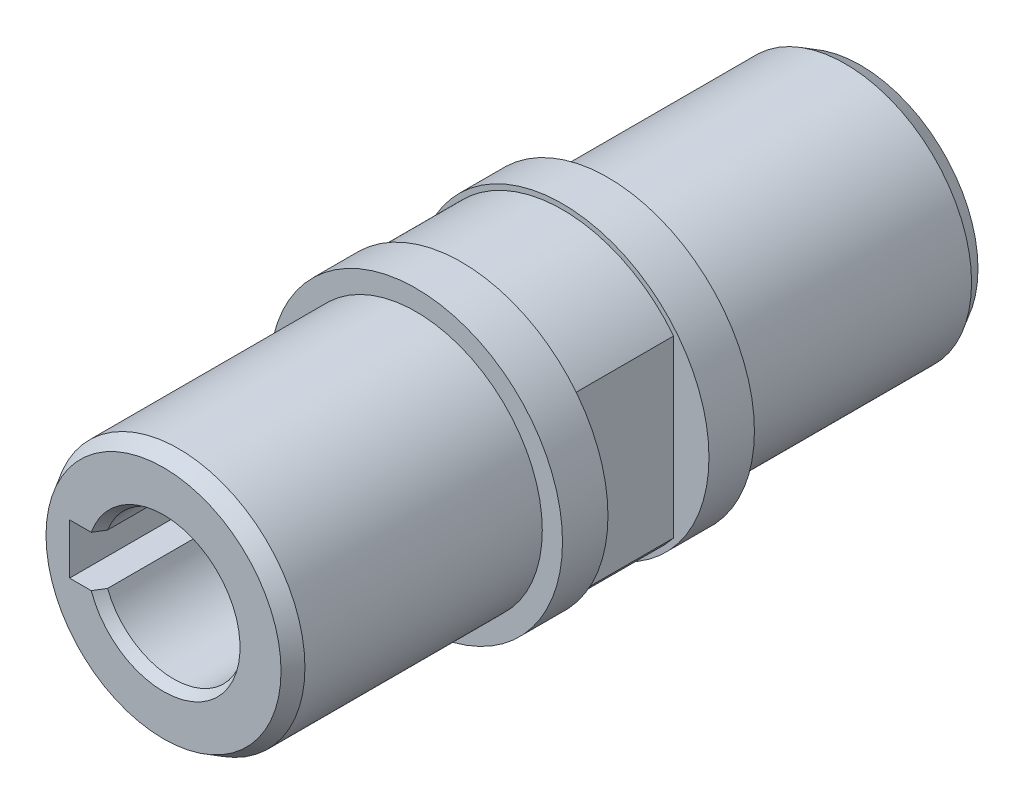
ISO-10303-21;
HEADER;
FILE_DESCRIPTION(('STEP AP214'),'2;1');
FILE_NAME('part.step','',(''),(''),'','','');
FILE_SCHEMA(('AUTOMOTIVE_DESIGN { 1 0 10303 214 1 1 1 1 }'));
ENDSEC;
DATA;
#1=APPLICATION_CONTEXT('core data for automotive mechanical design processes');
#2=APPLICATION_PROTOCOL_DEFINITION('international standard','automotive_design',2000,#1);
#3=PRODUCT_CONTEXT('',#1,'mechanical');
#4=PRODUCT('Part','Part','',(#3));
#5=PRODUCT_RELATED_PRODUCT_CATEGORY('part','',(#4));
#6=PRODUCT_DEFINITION_FORMATION('','',#4);
#7=PRODUCT_DEFINITION_CONTEXT('part definition',#1,'design');
#8=PRODUCT_DEFINITION('design','',#6,#7);
#9=PRODUCT_DEFINITION_SHAPE('','',#8);
#10=(LENGTH_UNIT() NAMED_UNIT(*) SI_UNIT(.MILLI.,.METRE.));
#11=(NAMED_UNIT(*) PLANE_ANGLE_UNIT() SI_UNIT($,.RADIAN.));
#12=(NAMED_UNIT(*) SI_UNIT($,.STERADIAN.) SOLID_ANGLE_UNIT());
#13=UNCERTAINTY_MEASURE_WITH_UNIT(LENGTH_MEASURE(1.E-05),#10,'distance_accuracy_value','');
#14=(GEOMETRIC_REPRESENTATION_CONTEXT(3) GLOBAL_UNCERTAINTY_ASSIGNED_CONTEXT((#13)) GLOBAL_UNIT_ASSIGNED_CONTEXT((#10,
#11,#12)) REPRESENTATION_CONTEXT('',''));
#15=CARTESIAN_POINT('',(0.,0.,0.));
#16=DIRECTION('',(0.,0.,1.));
#17=DIRECTION('',(1.,0.,0.));
#18=AXIS2_PLACEMENT_3D('',#15,#16,#17);
#19=CARTESIAN_POINT('',(0.,0.,-22.5));
#20=DIRECTION('',(0.,0.,1.));
#21=DIRECTION('',(1.,0.,0.));
#22=AXIS2_PLACEMENT_3D('',#19,#20,#21);
#23=PLANE('',#22);
#24=CARTESIAN_POINT('',(0.,0.,-22.5));
#25=DIRECTION('',(0.,0.,1.));
#26=DIRECTION('',(1.,0.,0.));
#27=AXIS2_PLACEMENT_3D('',#24,#25,#26);
#28=CIRCLE('',#27,14.5);
#29=CARTESIAN_POINT('',(14.5,0.,-22.5));
#30=VERTEX_POINT('',#29);
#31=EDGE_CURVE('E192',#30,#30,#28,.F.);
#32=ORIENTED_EDGE('',*,*,#31,.F.);
#33=EDGE_LOOP('',(#32));
#34=FACE_BOUND('',#33,.T.);
#35=CARTESIAN_POINT('',(0.,0.,-22.5));
#36=DIRECTION('',(0.,0.,-1.));
#37=DIRECTION('',(-1.,0.,0.));
#38=AXIS2_PLACEMENT_3D('',#35,#36,#37);
#39=CIRCLE('',#38,12.5);
#40=CARTESIAN_POINT('',(-12.5,0.,-22.5));
#41=VERTEX_POINT('',#40);
#42=EDGE_CURVE('E19',#41,#41,#39,.F.);
#43=ORIENTED_EDGE('',*,*,#42,.F.);
#44=EDGE_LOOP('',(#43));
#45=FACE_BOUND('',#44,.T.);
#46=ADVANCED_FACE('F15',(#34,#45),#23,.T.);
#47=CARTESIAN_POINT('',(0.,0.,-22.5));
#48=DIRECTION('',(0.,0.,-1.));
#49=DIRECTION('',(-1.,0.,0.));
#50=AXIS2_PLACEMENT_3D('',#47,#48,#49);
#51=CYLINDRICAL_SURFACE('',#50,12.5);
#52=ORIENTED_EDGE('',*,*,#42,.T.);
#53=EDGE_LOOP('',(#52));
#54=FACE_BOUND('',#53,.T.);
#55=CARTESIAN_POINT('',(0.,0.,0.999999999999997));
#56=DIRECTION('',(0.,0.,-1.));
#57=DIRECTION('',(-1.,0.,0.));
#58=AXIS2_PLACEMENT_3D('',#55,#56,#57);
#59=CIRCLE('',#58,12.5);
#60=CARTESIAN_POINT('',(-12.5,0.,0.999999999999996));
#61=VERTEX_POINT('',#60);
#62=EDGE_CURVE('E187',#61,#61,#59,.F.);
#63=ORIENTED_EDGE('',*,*,#62,.F.);
#64=EDGE_LOOP('',(#63));
#65=FACE_BOUND('',#64,.T.);
#66=ADVANCED_FACE('F365',(#54,#65),#51,.T.);
#67=CARTESIAN_POINT('',(0.,0.,2.49999999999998));
#68=DIRECTION('',(0.,0.,1.));
#69=DIRECTION('',(1.,0.,0.));
#70=AXIS2_PLACEMENT_3D('',#67,#68,#69);
#71=CYLINDRICAL_SURFACE('',#70,14.5);
#72=ORIENTED_EDGE('',*,*,#31,.T.);
#73=EDGE_LOOP('',(#72));
#74=FACE_BOUND('',#73,.T.);
#75=CARTESIAN_POINT('',(0.,0.,-27.));
#76=DIRECTION('',(0.,0.,1.));
#77=DIRECTION('',(1.,0.,0.));
#78=AXIS2_PLACEMENT_3D('',#75,#76,#77);
#79=CIRCLE('',#78,14.5);
#80=CARTESIAN_POINT('',(14.5,0.,-27.));
#81=VERTEX_POINT('',#80);
#82=EDGE_CURVE('E350',#81,#81,#79,.T.);
#83=ORIENTED_EDGE('',*,*,#82,.T.);
#84=EDGE_LOOP('',(#83));
#85=FACE_BOUND('',#84,.T.);
#86=ADVANCED_FACE('F374',(#74,#85),#71,.T.);
#87=CARTESIAN_POINT('',(0.,0.,0.999999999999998));
#88=DIRECTION('',(0.,0.,-1.));
#89=DIRECTION('',(-1.,0.,0.));
#90=AXIS2_PLACEMENT_3D('',#87,#88,#89);
#91=CONICAL_SURFACE('',#90,12.5,0.523598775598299);
#92=CARTESIAN_POINT('',(0.,0.,2.49999999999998));
#93=DIRECTION('',(0.,0.,-1.));
#94=DIRECTION('',(-1.,0.,0.));
#95=AXIS2_PLACEMENT_3D('',#92,#93,#94);
#96=CIRCLE('',#95,11.6339745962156);
#97=CARTESIAN_POINT('',(-11.6339745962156,0.,2.49999999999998));
#98=VERTEX_POINT('',#97);
#99=EDGE_CURVE('E386',#98,#98,#96,.F.);
#100=ORIENTED_EDGE('',*,*,#99,.F.);
#101=EDGE_LOOP('',(#100));
#102=FACE_BOUND('',#101,.T.);
#103=ORIENTED_EDGE('',*,*,#62,.T.);
#104=EDGE_LOOP('',(#103));
#105=FACE_BOUND('',#104,.T.);
#106=ADVANCED_FACE('F199',(#102,#105),#91,.T.);
#107=CARTESIAN_POINT('',(0.,0.,2.49999999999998));
#108=DIRECTION('',(0.,0.,1.));
#109=DIRECTION('',(1.,0.,0.));
#110=AXIS2_PLACEMENT_3D('',#107,#108,#109);
#111=CONICAL_SURFACE('',#110,7.57735026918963,0.523598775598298);
#112=CARTESIAN_POINT('',(0.,0.,1.49999999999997));
#113=DIRECTION('',(0.,0.,-1.));
#114=DIRECTION('',(-1.,0.,0.));
#115=AXIS2_PLACEMENT_3D('',#112,#113,#114);
#116=CIRCLE('',#115,7.);
#117=CARTESIAN_POINT('',(-6.53834841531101,2.5,1.49999999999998));
#118=VERTEX_POINT('',#117);
#119=CARTESIAN_POINT('',(-6.53834841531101,-2.5,1.49999999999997));
#120=VERTEX_POINT('',#119);
#121=EDGE_CURVE('E329',#118,#120,#116,.T.);
#122=ORIENTED_EDGE('',*,*,#121,.T.);
#123=CARTESIAN_POINT('',(-7.15305788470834,-2.5,2.49999999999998));
#124=CARTESIAN_POINT('',(-7.05099975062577,-2.5,2.33309149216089));
#125=CARTESIAN_POINT('',(-6.94874489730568,-2.5,2.1663039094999));
#126=CARTESIAN_POINT('',(-6.74384174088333,-2.5,1.83297057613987));
#127=CARTESIAN_POINT('',(-6.64119343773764,-2.5,1.66642482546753));
#128=CARTESIAN_POINT('',(-6.53834841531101,-2.5,1.49999999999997));
#129=B_SPLINE_CURVE_WITH_KNOTS('',3,(#123,#124,#125,#126,#127,#128),.UNSPECIFIED.,.F.,.F.,(4,2,
4),(0.,0.586913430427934,1.17382692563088),.UNSPECIFIED.);
#130=CARTESIAN_POINT('',(-7.15305788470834,-2.5,2.49999999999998));
#131=VERTEX_POINT('',#130);
#132=EDGE_CURVE('E96',#131,#120,#129,.T.);
#133=ORIENTED_EDGE('',*,*,#132,.F.);
#134=CARTESIAN_POINT('',(0.,0.,2.49999999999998));
#135=DIRECTION('',(0.,0.,1.));
#136=DIRECTION('',(1.,0.,0.));
#137=AXIS2_PLACEMENT_3D('',#134,#135,#136);
#138=CIRCLE('',#137,7.57735026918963);
#139=CARTESIAN_POINT('',(-7.15305788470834,2.5,2.49999999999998));
#140=VERTEX_POINT('',#139);
#141=EDGE_CURVE('E331',#140,#131,#138,.F.);
#142=ORIENTED_EDGE('',*,*,#141,.F.);
#143=CARTESIAN_POINT('',(-6.53834841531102,2.5,1.49999999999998));
#144=CARTESIAN_POINT('',(-6.64119343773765,2.5,1.66642482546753));
#145=CARTESIAN_POINT('',(-6.74384174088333,2.5,1.83297057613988));
#146=CARTESIAN_POINT('',(-6.94874489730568,2.5,2.1663039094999));
#147=CARTESIAN_POINT('',(-7.05099975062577,2.5,2.33309149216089));
#148=CARTESIAN_POINT('',(-7.15305788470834,2.5,2.49999999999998));
#149=B_SPLINE_CURVE_WITH_KNOTS('',3,(#143,#144,#145,#146,#147,#148),.UNSPECIFIED.,.F.,.F.,(4,2,
4),(0.,0.586913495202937,1.17382692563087),.UNSPECIFIED.);
#150=EDGE_CURVE('E186',#118,#140,#149,.T.);
#151=ORIENTED_EDGE('',*,*,#150,.F.);
#152=EDGE_LOOP('',(#122,#133,#142,#151));
#153=FACE_BOUND('',#152,.T.);
#154=ADVANCED_FACE('F193',(#153),#111,.F.);
#155=CARTESIAN_POINT('',(0.,7.25,-24.5));
#156=DIRECTION('',(0.,0.,1.));
#157=DIRECTION('',(1.,0.,0.));
#158=AXIS2_PLACEMENT_3D('',#155,#156,#157);
#159=PLANE('',#158);
#160=CARTESIAN_POINT('',(0.,0.,-24.5));
#161=DIRECTION('',(0.,0.,1.));
#162=DIRECTION('',(1.,0.,0.));
#163=AXIS2_PLACEMENT_3D('',#160,#161,#162);
#164=CIRCLE('',#163,7.25);
#165=CARTESIAN_POINT('',(-6.8053287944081,2.5,-24.5));
#166=VERTEX_POINT('',#165);
#167=CARTESIAN_POINT('',(-6.8053287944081,-2.5,-24.5));
#168=VERTEX_POINT('',#167);
#169=EDGE_CURVE('E394',#166,#168,#164,.F.);
#170=ORIENTED_EDGE('',*,*,#169,.T.);
#171=DIRECTION('',(1.,0.,0.));
#172=VECTOR('',#171,1.);
#173=CARTESIAN_POINT('',(0.,-2.5,-24.5));
#174=LINE('',#173,#172);
#175=CARTESIAN_POINT('',(-6.53834841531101,-2.5,-24.5));
#176=VERTEX_POINT('',#175);
#177=EDGE_CURVE('E351',#176,#168,#174,.F.);
#178=ORIENTED_EDGE('',*,*,#177,.F.);
#179=CARTESIAN_POINT('',(0.,0.,-24.5));
#180=DIRECTION('',(0.,0.,-1.));
#181=DIRECTION('',(-1.,0.,0.));
#182=AXIS2_PLACEMENT_3D('',#179,#180,#181);
#183=CIRCLE('',#182,7.);
#184=CARTESIAN_POINT('',(-6.53834841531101,2.5,-24.5));
#185=VERTEX_POINT('',#184);
#186=EDGE_CURVE('E330',#176,#185,#183,.F.);
#187=ORIENTED_EDGE('',*,*,#186,.T.);
#188=DIRECTION('',(1.,0.,0.));
#189=VECTOR('',#188,1.);
#190=CARTESIAN_POINT('',(0.,2.5,-24.5));
#191=LINE('',#190,#189);
#192=EDGE_CURVE('E348',#166,#185,#191,.T.);
#193=ORIENTED_EDGE('',*,*,#192,.F.);
#194=EDGE_LOOP('',(#170,#178,#187,#193));
#195=FACE_BOUND('',#194,.T.);
#196=ADVANCED_FACE('F198',(#195),#159,.F.);
#197=CARTESIAN_POINT('',(0.,7.,-39.5));
#198=DIRECTION('',(0.,0.,-1.));
#199=DIRECTION('',(-1.,0.,0.));
#200=AXIS2_PLACEMENT_3D('',#197,#198,#199);
#201=PLANE('',#200);
#202=CARTESIAN_POINT('',(0.,0.,-39.5));
#203=DIRECTION('',(0.,0.,-1.));
#204=DIRECTION('',(-1.,0.,0.));
#205=AXIS2_PLACEMENT_3D('',#202,#203,#204);
#206=CIRCLE('',#205,7.);
#207=CARTESIAN_POINT('',(-6.53834841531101,2.5,-39.5));
#208=VERTEX_POINT('',#207);
#209=CARTESIAN_POINT('',(-6.53834841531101,-2.5,-39.5));
#210=VERTEX_POINT('',#209);
#211=EDGE_CURVE('E384',#208,#210,#206,.T.);
#212=ORIENTED_EDGE('',*,*,#211,.T.);
#213=DIRECTION('',(-1.,0.,0.));
#214=VECTOR('',#213,1.);
#215=CARTESIAN_POINT('',(0.,-2.5,-39.5));
#216=LINE('',#215,#214);
#217=CARTESIAN_POINT('',(-6.8053287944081,-2.5,-39.5));
#218=VERTEX_POINT('',#217);
#219=EDGE_CURVE('E345',#218,#210,#216,.F.);
#220=ORIENTED_EDGE('',*,*,#219,.F.);
#221=CARTESIAN_POINT('',(0.,0.,-39.5));
#222=DIRECTION('',(0.,0.,1.));
#223=DIRECTION('',(1.,0.,0.));
#224=AXIS2_PLACEMENT_3D('',#221,#222,#223);
#225=CIRCLE('',#224,7.25);
#226=CARTESIAN_POINT('',(-6.8053287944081,2.5,-39.5));
#227=VERTEX_POINT('',#226);
#228=EDGE_CURVE('E397',#218,#227,#225,.T.);
#229=ORIENTED_EDGE('',*,*,#228,.T.);
#230=DIRECTION('',(-1.,0.,0.));
#231=VECTOR('',#230,1.);
#232=CARTESIAN_POINT('',(0.,2.5,-39.5));
#233=LINE('',#232,#231);
#234=EDGE_CURVE('E347',#208,#227,#233,.T.);
#235=ORIENTED_EDGE('',*,*,#234,.F.);
#236=EDGE_LOOP('',(#212,#220,#229,#235));
#237=FACE_BOUND('',#236,.T.);
#238=ADVANCED_FACE('F204',(#237),#201,.F.);
#239=CARTESIAN_POINT('',(0.,0.,-27.));
#240=DIRECTION('',(0.,0.,1.));
#241=DIRECTION('',(1.,0.,0.));
#242=AXIS2_PLACEMENT_3D('',#239,#240,#241);
#243=PLANE('',#242);
#244=ORIENTED_EDGE('',*,*,#82,.F.);
#245=EDGE_LOOP('',(#244));
#246=FACE_BOUND('',#245,.T.);
#247=DIRECTION('',(0.,1.,0.));
#248=VECTOR('',#247,1.);
#249=CARTESIAN_POINT('',(11.,-11.,-27.));
#250=LINE('',#249,#248);
#251=CARTESIAN_POINT('',(11.,-8.66025403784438,-27.));
#252=VERTEX_POINT('',#251);
#253=CARTESIAN_POINT('',(11.,8.66025403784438,-27.));
#254=VERTEX_POINT('',#253);
#255=EDGE_CURVE('E133',#252,#254,#250,.T.);
#256=ORIENTED_EDGE('',*,*,#255,.T.);
#257=CARTESIAN_POINT('',(0.,0.,-27.));
#258=DIRECTION('',(0.,0.,-1.));
#259=DIRECTION('',(-1.,0.,0.));
#260=AXIS2_PLACEMENT_3D('',#257,#258,#259);
#261=CIRCLE('',#260,14.);
#262=CARTESIAN_POINT('',(-11.,8.66025403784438,-27.));
#263=VERTEX_POINT('',#262);
#264=EDGE_CURVE('E130',#263,#254,#261,.T.);
#265=ORIENTED_EDGE('',*,*,#264,.F.);
#266=DIRECTION('',(0.,1.,0.));
#267=VECTOR('',#266,1.);
#268=CARTESIAN_POINT('',(-11.,-11.,-27.));
#269=LINE('',#268,#267);
#270=CARTESIAN_POINT('',(-11.,-8.66025403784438,-27.));
#271=VERTEX_POINT('',#270);
#272=EDGE_CURVE('E298',#263,#271,#269,.F.);
#273=ORIENTED_EDGE('',*,*,#272,.T.);
#274=CARTESIAN_POINT('',(0.,0.,-27.));
#275=DIRECTION('',(0.,0.,-1.));
#276=DIRECTION('',(-1.,0.,0.));
#277=AXIS2_PLACEMENT_3D('',#274,#275,#276);
#278=CIRCLE('',#277,14.);
#279=EDGE_CURVE('E300',#252,#271,#278,.T.);
#280=ORIENTED_EDGE('',*,*,#279,.F.);
#281=EDGE_LOOP('',(#256,#265,#273,#280));
#282=FACE_BOUND('',#281,.T.);
#283=ADVANCED_FACE('F208',(#246,#282),#243,.F.);
#284=CARTESIAN_POINT('',(0.,0.,-73.5));
#285=DIRECTION('',(0.,0.,-1.));
#286=DIRECTION('',(-1.,0.,0.));
#287=AXIS2_PLACEMENT_3D('',#284,#285,#286);
#288=CYLINDRICAL_SURFACE('',#287,7.);
#289=DIRECTION('',(0.,0.,1.));
#290=VECTOR('',#289,1.);
#291=CARTESIAN_POINT('',(-6.53834841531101,2.50000000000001,202.5));
#292=LINE('',#291,#290);
#293=CARTESIAN_POINT('',(-6.53834841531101,2.49999999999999,-65.5));
#294=VERTEX_POINT('',#293);
#295=EDGE_CURVE('E291',#294,#208,#292,.T.);
#296=ORIENTED_EDGE('',*,*,#295,.F.);
#297=CARTESIAN_POINT('',(0.,0.,-65.5));
#298=DIRECTION('',(0.,0.,-1.));
#299=DIRECTION('',(-1.,0.,0.));
#300=AXIS2_PLACEMENT_3D('',#297,#298,#299);
#301=CIRCLE('',#300,7.);
#302=CARTESIAN_POINT('',(-6.538348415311,-2.5,-65.5));
#303=VERTEX_POINT('',#302);
#304=EDGE_CURVE('E310',#294,#303,#301,.T.);
#305=ORIENTED_EDGE('',*,*,#304,.T.);
#306=DIRECTION('',(0.,0.,1.));
#307=VECTOR('',#306,1.);
#308=CARTESIAN_POINT('',(-6.53834841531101,-2.50000000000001,-197.5));
#309=LINE('',#308,#307);
#310=EDGE_CURVE('E164',#210,#303,#309,.F.);
#311=ORIENTED_EDGE('',*,*,#310,.F.);
#312=ORIENTED_EDGE('',*,*,#211,.F.);
#313=EDGE_LOOP('',(#296,#305,#311,#312));
#314=FACE_BOUND('',#313,.T.);
#315=ADVANCED_FACE('F212',(#314),#288,.F.);
#316=CARTESIAN_POINT('',(0.,0.,2.49999999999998));
#317=DIRECTION('',(0.,0.,1.));
#318=DIRECTION('',(1.,0.,0.));
#319=AXIS2_PLACEMENT_3D('',#316,#317,#318);
#320=PLANE('',#319);
#321=DIRECTION('',(-1.,0.,0.));
#322=VECTOR('',#321,1.);
#323=CARTESIAN_POINT('',(-9.3,-2.5,2.49999999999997));
#324=LINE('',#323,#322);
#325=CARTESIAN_POINT('',(-9.3,-2.5,2.49999999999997));
#326=VERTEX_POINT('',#325);
#327=EDGE_CURVE('E279',#326,#131,#324,.F.);
#328=ORIENTED_EDGE('',*,*,#327,.F.);
#329=DIRECTION('',(0.,-1.,0.));
#330=VECTOR('',#329,1.);
#331=CARTESIAN_POINT('',(-9.3,2.50000000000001,2.49999999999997));
#332=LINE('',#331,#330);
#333=CARTESIAN_POINT('',(-9.3,2.5,2.49999999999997));
#334=VERTEX_POINT('',#333);
#335=EDGE_CURVE('E104',#326,#334,#332,.F.);
#336=ORIENTED_EDGE('',*,*,#335,.T.);
#337=DIRECTION('',(1.,0.,0.));
#338=VECTOR('',#337,1.);
#339=CARTESIAN_POINT('',(-9.3,2.5,2.49999999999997));
#340=LINE('',#339,#338);
#341=EDGE_CURVE('E292',#140,#334,#340,.F.);
#342=ORIENTED_EDGE('',*,*,#341,.F.);
#343=ORIENTED_EDGE('',*,*,#141,.T.);
#344=EDGE_LOOP('',(#328,#336,#342,#343));
#345=FACE_BOUND('',#344,.T.);
#346=ORIENTED_EDGE('',*,*,#99,.T.);
#347=EDGE_LOOP('',(#346));
#348=FACE_BOUND('',#347,.T.);
#349=ADVANCED_FACE('F216',(#345,#348),#320,.T.);
#350=CARTESIAN_POINT('',(0.,0.,-73.5));
#351=DIRECTION('',(0.,0.,-1.));
#352=DIRECTION('',(-1.,0.,0.));
#353=AXIS2_PLACEMENT_3D('',#350,#351,#352);
#354=CYLINDRICAL_SURFACE('',#353,7.);
#355=ORIENTED_EDGE('',*,*,#186,.F.);
#356=DIRECTION('',(0.,0.,1.));
#357=VECTOR('',#356,1.);
#358=CARTESIAN_POINT('',(-6.53834841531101,-2.50000000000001,-197.5));
#359=LINE('',#358,#357);
#360=EDGE_CURVE('E151',#120,#176,#359,.F.);
#361=ORIENTED_EDGE('',*,*,#360,.F.);
#362=ORIENTED_EDGE('',*,*,#121,.F.);
#363=DIRECTION('',(0.,0.,1.));
#364=VECTOR('',#363,1.);
#365=CARTESIAN_POINT('',(-6.53834841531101,2.50000000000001,202.5));
#366=LINE('',#365,#364);
#367=EDGE_CURVE('E318',#185,#118,#366,.T.);
#368=ORIENTED_EDGE('',*,*,#367,.F.);
#369=EDGE_LOOP('',(#355,#361,#362,#368));
#370=FACE_BOUND('',#369,.T.);
#371=ADVANCED_FACE('F220',(#370),#354,.F.);
#372=CARTESIAN_POINT('',(0.,0.,-73.5));
#373=DIRECTION('',(0.,0.,1.));
#374=DIRECTION('',(1.,0.,0.));
#375=AXIS2_PLACEMENT_3D('',#372,#373,#374);
#376=CYLINDRICAL_SURFACE('',#375,7.25);
#377=ORIENTED_EDGE('',*,*,#228,.F.);
#378=DIRECTION('',(0.,0.,1.));
#379=VECTOR('',#378,1.);
#380=CARTESIAN_POINT('',(-6.8053287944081,-2.50000000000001,-197.5));
#381=LINE('',#380,#379);
#382=EDGE_CURVE('E148',#168,#218,#381,.F.);
#383=ORIENTED_EDGE('',*,*,#382,.F.);
#384=ORIENTED_EDGE('',*,*,#169,.F.);
#385=DIRECTION('',(0.,0.,1.));
#386=VECTOR('',#385,1.);
#387=CARTESIAN_POINT('',(-6.8053287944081,2.50000000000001,202.5));
#388=LINE('',#387,#386);
#389=EDGE_CURVE('E307',#227,#166,#388,.T.);
#390=ORIENTED_EDGE('',*,*,#389,.F.);
#391=EDGE_LOOP('',(#377,#383,#384,#390));
#392=FACE_BOUND('',#391,.T.);
#393=ADVANCED_FACE('F224',(#392),#376,.F.);
#394=CARTESIAN_POINT('',(0.,0.,-37.));
#395=DIRECTION('',(0.,0.,-1.));
#396=DIRECTION('',(-1.,0.,0.));
#397=AXIS2_PLACEMENT_3D('',#394,#395,#396);
#398=CYLINDRICAL_SURFACE('',#397,14.);
#399=CARTESIAN_POINT('',(0.,0.,-37.));
#400=DIRECTION('',(0.,0.,-1.));
#401=DIRECTION('',(-1.,0.,0.));
#402=AXIS2_PLACEMENT_3D('',#399,#400,#401);
#403=CIRCLE('',#402,14.);
#404=CARTESIAN_POINT('',(-11.,8.66025403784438,-37.));
#405=VERTEX_POINT('',#404);
#406=CARTESIAN_POINT('',(11.,8.66025403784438,-37.));
#407=VERTEX_POINT('',#406);
#408=EDGE_CURVE('E128',#405,#407,#403,.T.);
#409=ORIENTED_EDGE('',*,*,#408,.F.);
#410=DIRECTION('',(0.,0.,-1.));
#411=VECTOR('',#410,1.);
#412=CARTESIAN_POINT('',(-11.,8.66025403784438,-27.));
#413=LINE('',#412,#411);
#414=EDGE_CURVE('E297',#405,#263,#413,.F.);
#415=ORIENTED_EDGE('',*,*,#414,.T.);
#416=ORIENTED_EDGE('',*,*,#264,.T.);
#417=DIRECTION('',(0.,0.,1.));
#418=VECTOR('',#417,1.);
#419=CARTESIAN_POINT('',(11.,8.66025403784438,-27.));
#420=LINE('',#419,#418);
#421=EDGE_CURVE('E123',#254,#407,#420,.F.);
#422=ORIENTED_EDGE('',*,*,#421,.T.);
#423=EDGE_LOOP('',(#409,#415,#416,#422));
#424=FACE_BOUND('',#423,.T.);
#425=ADVANCED_FACE('F125',(#424),#398,.T.);
#426=CARTESIAN_POINT('',(11.,-11.,-27.));
#427=DIRECTION('',(-1.,0.,0.));
#428=DIRECTION('',(0.,0.,1.));
#429=AXIS2_PLACEMENT_3D('',#426,#427,#428);
#430=PLANE('',#429);
#431=DIRECTION('',(0.,1.,0.));
#432=VECTOR('',#431,1.);
#433=CARTESIAN_POINT('',(11.,0.,-37.));
#434=LINE('',#433,#432);
#435=CARTESIAN_POINT('',(11.,-8.66025403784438,-37.));
#436=VERTEX_POINT('',#435);
#437=EDGE_CURVE('E136',#407,#436,#434,.F.);
#438=ORIENTED_EDGE('',*,*,#437,.F.);
#439=ORIENTED_EDGE('',*,*,#421,.F.);
#440=ORIENTED_EDGE('',*,*,#255,.F.);
#441=DIRECTION('',(0.,0.,-1.));
#442=VECTOR('',#441,1.);
#443=CARTESIAN_POINT('',(11.,-8.66025403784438,-37.));
#444=LINE('',#443,#442);
#445=EDGE_CURVE('E132',#436,#252,#444,.F.);
#446=ORIENTED_EDGE('',*,*,#445,.F.);
#447=EDGE_LOOP('',(#438,#439,#440,#446));
#448=FACE_BOUND('',#447,.T.);
#449=ADVANCED_FACE('F137',(#448),#430,.F.);
#450=CARTESIAN_POINT('',(0.,0.,-37.));
#451=DIRECTION('',(0.,0.,-1.));
#452=DIRECTION('',(-1.,0.,0.));
#453=AXIS2_PLACEMENT_3D('',#450,#451,#452);
#454=CYLINDRICAL_SURFACE('',#453,14.);
#455=ORIENTED_EDGE('',*,*,#279,.T.);
#456=DIRECTION('',(0.,0.,-1.));
#457=VECTOR('',#456,1.);
#458=CARTESIAN_POINT('',(-11.,-8.66025403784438,-27.));
#459=LINE('',#458,#457);
#460=CARTESIAN_POINT('',(-11.,-8.66025403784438,-37.));
#461=VERTEX_POINT('',#460);
#462=EDGE_CURVE('E295',#271,#461,#459,.T.);
#463=ORIENTED_EDGE('',*,*,#462,.T.);
#464=CARTESIAN_POINT('',(0.,0.,-37.));
#465=DIRECTION('',(0.,0.,-1.));
#466=DIRECTION('',(-1.,0.,0.));
#467=AXIS2_PLACEMENT_3D('',#464,#465,#466);
#468=CIRCLE('',#467,14.);
#469=EDGE_CURVE('E142',#436,#461,#468,.T.);
#470=ORIENTED_EDGE('',*,*,#469,.F.);
#471=ORIENTED_EDGE('',*,*,#445,.T.);
#472=EDGE_LOOP('',(#455,#463,#470,#471));
#473=FACE_BOUND('',#472,.T.);
#474=ADVANCED_FACE('F233',(#473),#454,.T.);
#475=CARTESIAN_POINT('',(-11.,-11.,-27.));
#476=DIRECTION('',(1.,0.,0.));
#477=DIRECTION('',(0.,0.,-1.));
#478=AXIS2_PLACEMENT_3D('',#475,#476,#477);
#479=PLANE('',#478);
#480=DIRECTION('',(0.,1.,0.));
#481=VECTOR('',#480,1.);
#482=CARTESIAN_POINT('',(-11.,0.,-37.));
#483=LINE('',#482,#481);
#484=EDGE_CURVE('E147',#461,#405,#483,.T.);
#485=ORIENTED_EDGE('',*,*,#484,.F.);
#486=ORIENTED_EDGE('',*,*,#462,.F.);
#487=ORIENTED_EDGE('',*,*,#272,.F.);
#488=ORIENTED_EDGE('',*,*,#414,.F.);
#489=EDGE_LOOP('',(#485,#486,#487,#488));
#490=FACE_BOUND('',#489,.T.);
#491=ADVANCED_FACE('F236',(#490),#479,.F.);
#492=CARTESIAN_POINT('',(-9.3,2.50000000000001,202.5));
#493=DIRECTION('',(-1.,0.,0.));
#494=DIRECTION('',(0.,-1.,0.));
#495=AXIS2_PLACEMENT_3D('',#492,#493,#494);
#496=PLANE('',#495);
#497=DIRECTION('',(0.,0.,1.));
#498=VECTOR('',#497,1.);
#499=CARTESIAN_POINT('',(-9.3,-2.50000000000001,-197.5));
#500=LINE('',#499,#498);
#501=CARTESIAN_POINT('',(-9.3,-2.5,-66.5));
#502=VERTEX_POINT('',#501);
#503=EDGE_CURVE('E163',#502,#326,#500,.T.);
#504=ORIENTED_EDGE('',*,*,#503,.F.);
#505=DIRECTION('',(0.,1.,0.));
#506=VECTOR('',#505,1.);
#507=CARTESIAN_POINT('',(-9.3,0.,-66.5));
#508=LINE('',#507,#506);
#509=CARTESIAN_POINT('',(-9.3,2.5,-66.5));
#510=VERTEX_POINT('',#509);
#511=EDGE_CURVE('E282',#502,#510,#508,.T.);
#512=ORIENTED_EDGE('',*,*,#511,.T.);
#513=DIRECTION('',(0.,0.,1.));
#514=VECTOR('',#513,1.);
#515=CARTESIAN_POINT('',(-9.3,2.50000000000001,202.5));
#516=LINE('',#515,#514);
#517=EDGE_CURVE('E288',#334,#510,#516,.F.);
#518=ORIENTED_EDGE('',*,*,#517,.F.);
#519=ORIENTED_EDGE('',*,*,#335,.F.);
#520=EDGE_LOOP('',(#504,#512,#518,#519));
#521=FACE_BOUND('',#520,.T.);
#522=ADVANCED_FACE('F240',(#521),#496,.F.);
#523=CARTESIAN_POINT('',(-9.3,2.50000000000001,202.5));
#524=DIRECTION('',(0.,-1.,0.));
#525=DIRECTION('',(1.,0.,0.));
#526=AXIS2_PLACEMENT_3D('',#523,#524,#525);
#527=PLANE('',#526);
#528=CARTESIAN_POINT('',(-7.15305788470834,2.49999999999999,-66.5));
#529=CARTESIAN_POINT('',(-7.05099975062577,2.49999999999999,-66.3330914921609));
#530=CARTESIAN_POINT('',(-6.94874489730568,2.49999999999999,-66.1663039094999));
#531=CARTESIAN_POINT('',(-6.74384174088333,2.49999999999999,-65.8329705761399));
#532=CARTESIAN_POINT('',(-6.64119343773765,2.49999999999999,-65.6664248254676));
#533=CARTESIAN_POINT('',(-6.53834841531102,2.49999999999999,-65.5));
#534=B_SPLINE_CURVE_WITH_KNOTS('',3,(#528,#529,#530,#531,#532,#533),.UNSPECIFIED.,.F.,.F.,(4,2,
4),(0.,0.586913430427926,1.17382692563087),.UNSPECIFIED.);
#535=CARTESIAN_POINT('',(-7.15305788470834,2.5,-66.5));
#536=VERTEX_POINT('',#535);
#537=EDGE_CURVE('E165',#536,#294,#534,.T.);
#538=ORIENTED_EDGE('',*,*,#537,.T.);
#539=ORIENTED_EDGE('',*,*,#295,.T.);
#540=ORIENTED_EDGE('',*,*,#234,.T.);
#541=ORIENTED_EDGE('',*,*,#389,.T.);
#542=ORIENTED_EDGE('',*,*,#192,.T.);
#543=ORIENTED_EDGE('',*,*,#367,.T.);
#544=ORIENTED_EDGE('',*,*,#150,.T.);
#545=ORIENTED_EDGE('',*,*,#341,.T.);
#546=ORIENTED_EDGE('',*,*,#517,.T.);
#547=DIRECTION('',(1.,0.,0.));
#548=VECTOR('',#547,1.);
#549=CARTESIAN_POINT('',(0.,2.5,-66.5));
#550=LINE('',#549,#548);
#551=EDGE_CURVE('E285',#510,#536,#550,.T.);
#552=ORIENTED_EDGE('',*,*,#551,.T.);
#553=EDGE_LOOP('',(#538,#539,#540,#541,#542,#543,#544,#545,#546,#552));
#554=FACE_BOUND('',#553,.T.);
#555=ADVANCED_FACE('F243',(#554),#527,.T.);
#556=CARTESIAN_POINT('',(0.,0.,-66.5));
#557=DIRECTION('',(0.,0.,-1.));
#558=DIRECTION('',(-1.,0.,0.));
#559=AXIS2_PLACEMENT_3D('',#556,#557,#558);
#560=CONICAL_SURFACE('',#559,7.57735026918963,0.523598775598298);
#561=ORIENTED_EDGE('',*,*,#304,.F.);
#562=ORIENTED_EDGE('',*,*,#537,.F.);
#563=CARTESIAN_POINT('',(0.,0.,-66.5));
#564=DIRECTION('',(0.,0.,-1.));
#565=DIRECTION('',(-1.,0.,0.));
#566=AXIS2_PLACEMENT_3D('',#563,#564,#565);
#567=CIRCLE('',#566,7.57735026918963);
#568=CARTESIAN_POINT('',(-7.15305788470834,-2.5,-66.5));
#569=VERTEX_POINT('',#568);
#570=EDGE_CURVE('E34',#536,#569,#567,.T.);
#571=ORIENTED_EDGE('',*,*,#570,.T.);
#572=CARTESIAN_POINT('',(-6.53834841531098,-2.5,-65.4999999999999));
#573=CARTESIAN_POINT('',(-6.64119343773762,-2.5,-65.6664248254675));
#574=CARTESIAN_POINT('',(-6.7438417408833,-2.5,-65.8329705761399));
#575=CARTESIAN_POINT('',(-6.94874489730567,-2.5,-66.1663039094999));
#576=CARTESIAN_POINT('',(-7.05099975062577,-2.5,-66.3330914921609));
#577=CARTESIAN_POINT('',(-7.15305788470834,-2.5,-66.5));
#578=B_SPLINE_CURVE_WITH_KNOTS('',3,(#572,#573,#574,#575,#576,#577),.UNSPECIFIED.,.F.,.F.,(4,2,
4),(0.,0.586913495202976,1.17382692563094),.UNSPECIFIED.);
#579=EDGE_CURVE('E156',#303,#569,#578,.T.);
#580=ORIENTED_EDGE('',*,*,#579,.F.);
#581=EDGE_LOOP('',(#561,#562,#571,#580));
#582=FACE_BOUND('',#581,.T.);
#583=ADVANCED_FACE('F171',(#582),#560,.F.);
#584=CARTESIAN_POINT('',(-9.3,-2.50000000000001,-197.5));
#585=DIRECTION('',(0.,1.,0.));
#586=DIRECTION('',(-1.,0.,0.));
#587=AXIS2_PLACEMENT_3D('',#584,#585,#586);
#588=PLANE('',#587);
#589=ORIENTED_EDGE('',*,*,#177,.T.);
#590=ORIENTED_EDGE('',*,*,#382,.T.);
#591=ORIENTED_EDGE('',*,*,#219,.T.);
#592=ORIENTED_EDGE('',*,*,#310,.T.);
#593=ORIENTED_EDGE('',*,*,#579,.T.);
#594=DIRECTION('',(1.,0.,0.));
#595=VECTOR('',#594,1.);
#596=CARTESIAN_POINT('',(0.,-2.5,-66.5));
#597=LINE('',#596,#595);
#598=EDGE_CURVE('E337',#569,#502,#597,.F.);
#599=ORIENTED_EDGE('',*,*,#598,.T.);
#600=ORIENTED_EDGE('',*,*,#503,.T.);
#601=ORIENTED_EDGE('',*,*,#327,.T.);
#602=ORIENTED_EDGE('',*,*,#132,.T.);
#603=ORIENTED_EDGE('',*,*,#360,.T.);
#604=EDGE_LOOP('',(#589,#590,#591,#592,#593,#599,#600,#601,#602,#603));
#605=FACE_BOUND('',#604,.T.);
#606=ADVANCED_FACE('F173',(#605),#588,.T.);
#607=CARTESIAN_POINT('',(0.,0.,-37.));
#608=DIRECTION('',(0.,0.,1.));
#609=DIRECTION('',(1.,0.,0.));
#610=AXIS2_PLACEMENT_3D('',#607,#608,#609);
#611=PLANE('',#610);
#612=CARTESIAN_POINT('',(0.,0.,-37.));
#613=DIRECTION('',(0.,0.,1.));
#614=DIRECTION('',(1.,0.,0.));
#615=AXIS2_PLACEMENT_3D('',#612,#613,#614);
#616=CIRCLE('',#615,14.5);
#617=CARTESIAN_POINT('',(14.5,0.,-37.));
#618=VERTEX_POINT('',#617);
#619=EDGE_CURVE('E335',#618,#618,#616,.F.);
#620=ORIENTED_EDGE('',*,*,#619,.F.);
#621=EDGE_LOOP('',(#620));
#622=FACE_BOUND('',#621,.T.);
#623=ORIENTED_EDGE('',*,*,#469,.T.);
#624=ORIENTED_EDGE('',*,*,#484,.T.);
#625=ORIENTED_EDGE('',*,*,#408,.T.);
#626=ORIENTED_EDGE('',*,*,#437,.T.);
#627=EDGE_LOOP('',(#623,#624,#625,#626));
#628=FACE_BOUND('',#627,.T.);
#629=ADVANCED_FACE('F145',(#622,#628),#611,.T.);
#630=CARTESIAN_POINT('',(0.,0.,-66.5));
#631=DIRECTION('',(0.,0.,1.));
#632=DIRECTION('',(1.,0.,0.));
#633=AXIS2_PLACEMENT_3D('',#630,#631,#632);
#634=PLANE('',#633);
#635=ORIENTED_EDGE('',*,*,#570,.F.);
#636=ORIENTED_EDGE('',*,*,#551,.F.);
#637=ORIENTED_EDGE('',*,*,#511,.F.);
#638=ORIENTED_EDGE('',*,*,#598,.F.);
#639=EDGE_LOOP('',(#635,#636,#637,#638));
#640=FACE_BOUND('',#639,.T.);
#641=CARTESIAN_POINT('',(0.,0.,-66.5));
#642=DIRECTION('',(0.,0.,1.));
#643=DIRECTION('',(1.,0.,0.));
#644=AXIS2_PLACEMENT_3D('',#641,#642,#643);
#645=CIRCLE('',#644,11.6339745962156);
#646=CARTESIAN_POINT('',(11.6339745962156,0.,-66.5));
#647=VERTEX_POINT('',#646);
#648=EDGE_CURVE('E269',#647,#647,#645,.T.);
#649=ORIENTED_EDGE('',*,*,#648,.F.);
#650=EDGE_LOOP('',(#649));
#651=FACE_BOUND('',#650,.T.);
#652=ADVANCED_FACE('F421',(#640,#651),#634,.F.);
#653=CARTESIAN_POINT('',(0.,0.,2.49999999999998));
#654=DIRECTION('',(0.,0.,1.));
#655=DIRECTION('',(1.,0.,0.));
#656=AXIS2_PLACEMENT_3D('',#653,#654,#655);
#657=CYLINDRICAL_SURFACE('',#656,14.5);
#658=ORIENTED_EDGE('',*,*,#619,.T.);
#659=EDGE_LOOP('',(#658));
#660=FACE_BOUND('',#659,.T.);
#661=CARTESIAN_POINT('',(0.,0.,-41.5));
#662=DIRECTION('',(0.,0.,1.));
#663=DIRECTION('',(1.,0.,0.));
#664=AXIS2_PLACEMENT_3D('',#661,#662,#663);
#665=CIRCLE('',#664,14.5);
#666=CARTESIAN_POINT('',(14.5,0.,-41.5));
#667=VERTEX_POINT('',#666);
#668=EDGE_CURVE('E266',#667,#667,#665,.F.);
#669=ORIENTED_EDGE('',*,*,#668,.F.);
#670=EDGE_LOOP('',(#669));
#671=FACE_BOUND('',#670,.T.);
#672=ADVANCED_FACE('F425',(#660,#671),#657,.T.);
#673=CARTESIAN_POINT('',(0.,0.,-65.));
#674=DIRECTION('',(0.,0.,1.));
#675=DIRECTION('',(1.,0.,0.));
#676=AXIS2_PLACEMENT_3D('',#673,#674,#675);
#677=CONICAL_SURFACE('',#676,12.5,0.523598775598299);
#678=CARTESIAN_POINT('',(0.,0.,-65.));
#679=DIRECTION('',(0.,0.,1.));
#680=DIRECTION('',(1.,0.,0.));
#681=AXIS2_PLACEMENT_3D('',#678,#679,#680);
#682=CIRCLE('',#681,12.5);
#683=CARTESIAN_POINT('',(12.5,0.,-65.));
#684=VERTEX_POINT('',#683);
#685=EDGE_CURVE('E25',#684,#684,#682,.T.);
#686=ORIENTED_EDGE('',*,*,#685,.F.);
#687=EDGE_LOOP('',(#686));
#688=FACE_BOUND('',#687,.T.);
#689=ORIENTED_EDGE('',*,*,#648,.T.);
#690=EDGE_LOOP('',(#689));
#691=FACE_BOUND('',#690,.T.);
#692=ADVANCED_FACE('F259',(#688,#691),#677,.T.);
#693=CARTESIAN_POINT('',(0.,0.,-41.5));
#694=DIRECTION('',(0.,0.,-1.));
#695=DIRECTION('',(-1.,0.,0.));
#696=AXIS2_PLACEMENT_3D('',#693,#694,#695);
#697=PLANE('',#696);
#698=ORIENTED_EDGE('',*,*,#668,.T.);
#699=EDGE_LOOP('',(#698));
#700=FACE_BOUND('',#699,.T.);
#701=CARTESIAN_POINT('',(0.,0.,-41.5));
#702=DIRECTION('',(0.,0.,1.));
#703=DIRECTION('',(1.,0.,0.));
#704=AXIS2_PLACEMENT_3D('',#701,#702,#703);
#705=CIRCLE('',#704,12.5);
#706=CARTESIAN_POINT('',(12.5,0.,-41.5));
#707=VERTEX_POINT('',#706);
#708=EDGE_CURVE('E10',#707,#707,#705,.F.);
#709=ORIENTED_EDGE('',*,*,#708,.F.);
#710=EDGE_LOOP('',(#709));
#711=FACE_BOUND('',#710,.T.);
#712=ADVANCED_FACE('F254',(#700,#711),#697,.T.);
#713=CARTESIAN_POINT('',(0.,0.,-41.5));
#714=DIRECTION('',(0.,0.,1.));
#715=DIRECTION('',(1.,0.,0.));
#716=AXIS2_PLACEMENT_3D('',#713,#714,#715);
#717=CYLINDRICAL_SURFACE('',#716,12.5);
#718=ORIENTED_EDGE('',*,*,#708,.T.);
#719=EDGE_LOOP('',(#718));
#720=FACE_BOUND('',#719,.T.);
#721=ORIENTED_EDGE('',*,*,#685,.T.);
#722=EDGE_LOOP('',(#721));
#723=FACE_BOUND('',#722,.T.);
#724=ADVANCED_FACE('F17',(#720,#723),#717,.T.);
#725=CLOSED_SHELL('',(#46,#66,#86,#106,#154,#196,#238,#283,#315,#349,#371,#393,#425,#449,#474,
#491,#522,#555,#583,#606,#629,#652,#672,#692,#712,#724));
#726=MANIFOLD_SOLID_BREP('B1',#725);
#727=ADVANCED_BREP_SHAPE_REPRESENTATION('',(#18,#726),#14);
#728=SHAPE_DEFINITION_REPRESENTATION(#9,#727);
ENDSEC;
END-ISO-10303-21;
